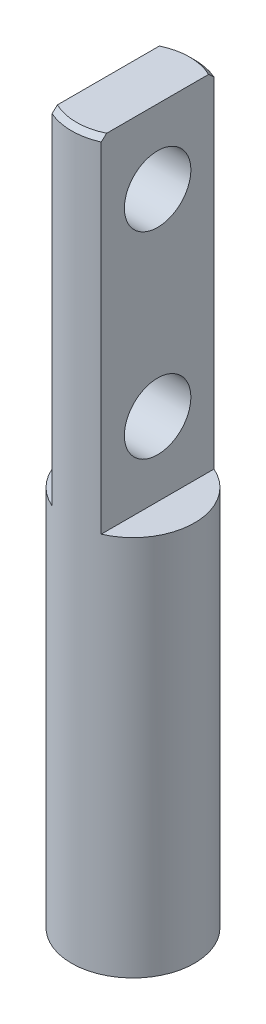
ISO-10303-21;
HEADER;
FILE_DESCRIPTION(('STEP AP214'),'2;1');
FILE_NAME('part.step','',(''),(''),'','','');
FILE_SCHEMA(('AUTOMOTIVE_DESIGN { 1 0 10303 214 1 1 1 1 }'));
ENDSEC;
DATA;
#1=APPLICATION_CONTEXT('core data for automotive mechanical design processes');
#2=APPLICATION_PROTOCOL_DEFINITION('international standard','automotive_design',2000,#1);
#3=PRODUCT_CONTEXT('',#1,'mechanical');
#4=PRODUCT('Part','Part','',(#3));
#5=PRODUCT_RELATED_PRODUCT_CATEGORY('part','',(#4));
#6=PRODUCT_DEFINITION_FORMATION('','',#4);
#7=PRODUCT_DEFINITION_CONTEXT('part definition',#1,'design');
#8=PRODUCT_DEFINITION('design','',#6,#7);
#9=PRODUCT_DEFINITION_SHAPE('','',#8);
#10=(LENGTH_UNIT() NAMED_UNIT(*) SI_UNIT(.MILLI.,.METRE.));
#11=(NAMED_UNIT(*) PLANE_ANGLE_UNIT() SI_UNIT($,.RADIAN.));
#12=(NAMED_UNIT(*) SI_UNIT($,.STERADIAN.) SOLID_ANGLE_UNIT());
#13=UNCERTAINTY_MEASURE_WITH_UNIT(LENGTH_MEASURE(1.E-05),#10,'distance_accuracy_value','');
#14=(GEOMETRIC_REPRESENTATION_CONTEXT(3) GLOBAL_UNCERTAINTY_ASSIGNED_CONTEXT((#13)) GLOBAL_UNIT_ASSIGNED_CONTEXT((#10,
#11,#12)) REPRESENTATION_CONTEXT('',''));
#15=CARTESIAN_POINT('',(0.,0.,0.));
#16=DIRECTION('',(0.,0.,1.));
#17=DIRECTION('',(1.,0.,0.));
#18=AXIS2_PLACEMENT_3D('',#15,#16,#17);
#19=CARTESIAN_POINT('',(0.,15.5,0.));
#20=DIRECTION('',(0.,1.,0.));
#21=DIRECTION('',(0.,0.,1.));
#22=AXIS2_PLACEMENT_3D('',#19,#20,#21);
#23=PLANE('',#22);
#24=DIRECTION('',(0.,0.,-1.));
#25=VECTOR('',#24,1.);
#26=CARTESIAN_POINT('',(1.,15.5,2.29128784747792));
#27=LINE('',#26,#25);
#28=CARTESIAN_POINT('',(1.,15.5,2.29128784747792));
#29=VERTEX_POINT('',#28);
#30=CARTESIAN_POINT('',(1.,15.5,-2.29128784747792));
#31=VERTEX_POINT('',#30);
#32=EDGE_CURVE('E110',#29,#31,#27,.T.);
#33=ORIENTED_EDGE('',*,*,#32,.F.);
#34=CARTESIAN_POINT('',(0.,15.5,0.));
#35=DIRECTION('',(0.,1.,0.));
#36=DIRECTION('',(0.,0.,1.));
#37=AXIS2_PLACEMENT_3D('',#34,#35,#36);
#38=CIRCLE('',#37,2.5);
#39=EDGE_CURVE('E105',#29,#31,#38,.T.);
#40=ORIENTED_EDGE('',*,*,#39,.T.);
#41=EDGE_LOOP('',(#33,#40));
#42=FACE_BOUND('',#41,.T.);
#43=ADVANCED_FACE('F32',(#42),#23,.T.);
#44=CARTESIAN_POINT('',(0.,15.5,0.));
#45=DIRECTION('',(0.,-1.,0.));
#46=DIRECTION('',(0.,0.,-1.));
#47=AXIS2_PLACEMENT_3D('',#44,#45,#46);
#48=CYLINDRICAL_SURFACE('',#47,2.5);
#49=DIRECTION('',(0.,-1.,0.));
#50=VECTOR('',#49,1.);
#51=CARTESIAN_POINT('',(-1.,29.5,-2.29128784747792));
#52=LINE('',#51,#50);
#53=CARTESIAN_POINT('',(-1.,29.3,-2.29128784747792));
#54=VERTEX_POINT('',#53);
#55=CARTESIAN_POINT('',(-1.,15.5,-2.29128784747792));
#56=VERTEX_POINT('',#55);
#57=EDGE_CURVE('E98',#54,#56,#52,.T.);
#58=ORIENTED_EDGE('',*,*,#57,.F.);
#59=CARTESIAN_POINT('',(0.,29.3,0.));
#60=DIRECTION('',(0.,1.,0.));
#61=DIRECTION('',(0.,0.,1.));
#62=AXIS2_PLACEMENT_3D('',#59,#60,#61);
#63=CIRCLE('',#62,2.5);
#64=CARTESIAN_POINT('',(1.,29.3,-2.29128784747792));
#65=VERTEX_POINT('',#64);
#66=EDGE_CURVE('E52',#54,#65,#63,.F.);
#67=ORIENTED_EDGE('',*,*,#66,.T.);
#68=DIRECTION('',(0.,-1.,0.));
#69=VECTOR('',#68,1.);
#70=CARTESIAN_POINT('',(1.,29.5,-2.29128784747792));
#71=LINE('',#70,#69);
#72=EDGE_CURVE('E139',#65,#31,#71,.T.);
#73=ORIENTED_EDGE('',*,*,#72,.T.);
#74=ORIENTED_EDGE('',*,*,#39,.F.);
#75=DIRECTION('',(0.,-1.,0.));
#76=VECTOR('',#75,1.);
#77=CARTESIAN_POINT('',(1.,29.5,2.29128784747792));
#78=LINE('',#77,#76);
#79=CARTESIAN_POINT('',(1.,29.3,2.29128784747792));
#80=VERTEX_POINT('',#79);
#81=EDGE_CURVE('E99',#80,#29,#78,.T.);
#82=ORIENTED_EDGE('',*,*,#81,.F.);
#83=CARTESIAN_POINT('',(0.,29.3,0.));
#84=DIRECTION('',(0.,1.,0.));
#85=DIRECTION('',(0.,0.,1.));
#86=AXIS2_PLACEMENT_3D('',#83,#84,#85);
#87=CIRCLE('',#86,2.5);
#88=CARTESIAN_POINT('',(-1.,29.3,2.29128784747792));
#89=VERTEX_POINT('',#88);
#90=EDGE_CURVE('E94',#80,#89,#87,.F.);
#91=ORIENTED_EDGE('',*,*,#90,.T.);
#92=DIRECTION('',(0.,-1.,0.));
#93=VECTOR('',#92,1.);
#94=CARTESIAN_POINT('',(-1.,29.5,2.29128784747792));
#95=LINE('',#94,#93);
#96=CARTESIAN_POINT('',(-1.,15.5,2.29128784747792));
#97=VERTEX_POINT('',#96);
#98=EDGE_CURVE('E88',#89,#97,#95,.T.);
#99=ORIENTED_EDGE('',*,*,#98,.T.);
#100=EDGE_CURVE('E92',#56,#97,#38,.T.);
#101=ORIENTED_EDGE('',*,*,#100,.F.);
#102=EDGE_LOOP('',(#58,#67,#73,#74,#82,#91,#99,#101));
#103=FACE_BOUND('',#102,.T.);
#104=CARTESIAN_POINT('',(0.,0.,0.));
#105=DIRECTION('',(0.,1.,0.));
#106=DIRECTION('',(0.,0.,1.));
#107=AXIS2_PLACEMENT_3D('',#104,#105,#106);
#108=CIRCLE('',#107,2.5);
#109=CARTESIAN_POINT('',(0.,0.,2.5));
#110=VERTEX_POINT('',#109);
#111=EDGE_CURVE('E106',#110,#110,#108,.T.);
#112=ORIENTED_EDGE('',*,*,#111,.T.);
#113=EDGE_LOOP('',(#112));
#114=FACE_BOUND('',#113,.T.);
#115=ADVANCED_FACE('F90',(#103,#114),#48,.T.);
#116=DIRECTION('',(0.,0.,1.));
#117=VECTOR('',#116,1.);
#118=CARTESIAN_POINT('',(-1.,15.5,2.29128784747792));
#119=LINE('',#118,#117);
#120=EDGE_CURVE('E104',#56,#97,#119,.T.);
#121=ORIENTED_EDGE('',*,*,#120,.F.);
#122=ORIENTED_EDGE('',*,*,#100,.T.);
#123=EDGE_LOOP('',(#121,#122));
#124=FACE_BOUND('',#123,.T.);
#125=ADVANCED_FACE('F103',(#124),#23,.T.);
#126=CARTESIAN_POINT('',(0.,0.,0.));
#127=DIRECTION('',(0.,1.,0.));
#128=DIRECTION('',(0.,0.,1.));
#129=AXIS2_PLACEMENT_3D('',#126,#127,#128);
#130=PLANE('',#129);
#131=ORIENTED_EDGE('',*,*,#111,.F.);
#132=EDGE_LOOP('',(#131));
#133=FACE_BOUND('',#132,.T.);
#134=ADVANCED_FACE('F160',(#133),#130,.F.);
#135=CARTESIAN_POINT('',(-1.,29.5,2.29128784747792));
#136=DIRECTION('',(1.,0.,0.));
#137=DIRECTION('',(0.,0.,-1.));
#138=AXIS2_PLACEMENT_3D('',#135,#136,#137);
#139=PLANE('',#138);
#140=CARTESIAN_POINT('',(-1.,18.5,0.));
#141=DIRECTION('',(-1.,0.,0.));
#142=DIRECTION('',(0.,0.,1.));
#143=AXIS2_PLACEMENT_3D('',#140,#141,#142);
#144=CIRCLE('',#143,1.35);
#145=CARTESIAN_POINT('',(-1.,18.5,1.35));
#146=VERTEX_POINT('',#145);
#147=EDGE_CURVE('E292',#146,#146,#144,.T.);
#148=ORIENTED_EDGE('',*,*,#147,.F.);
#149=EDGE_LOOP('',(#148));
#150=FACE_BOUND('',#149,.T.);
#151=CARTESIAN_POINT('',(-1.,26.5,0.));
#152=DIRECTION('',(-1.,0.,0.));
#153=DIRECTION('',(0.,0.,1.));
#154=AXIS2_PLACEMENT_3D('',#151,#152,#153);
#155=CIRCLE('',#154,1.35);
#156=CARTESIAN_POINT('',(-1.,26.5,1.35));
#157=VERTEX_POINT('',#156);
#158=EDGE_CURVE('E117',#157,#157,#155,.T.);
#159=ORIENTED_EDGE('',*,*,#158,.F.);
#160=EDGE_LOOP('',(#159));
#161=FACE_BOUND('',#160,.T.);
#162=DIRECTION('',(0.,0.,1.));
#163=VECTOR('',#162,1.);
#164=CARTESIAN_POINT('',(-1.,29.5,2.29128784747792));
#165=LINE('',#164,#163);
#166=CARTESIAN_POINT('',(-1.,29.5,-2.07123151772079));
#167=VERTEX_POINT('',#166);
#168=CARTESIAN_POINT('',(-1.,29.5,2.07123151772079));
#169=VERTEX_POINT('',#168);
#170=EDGE_CURVE('E114',#167,#169,#165,.T.);
#171=ORIENTED_EDGE('',*,*,#170,.F.);
#172=CARTESIAN_POINT('',(-1.,29.5,-2.07123151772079));
#173=CARTESIAN_POINT('',(-1.,29.4668268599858,-2.10805317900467));
#174=CARTESIAN_POINT('',(-1.,29.4335736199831,-2.14480204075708));
#175=CARTESIAN_POINT('',(-1.,29.3669069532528,-2.21815415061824));
#176=CARTESIAN_POINT('',(-1.,29.3334935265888,-2.25475739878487));
#177=CARTESIAN_POINT('',(-1.,29.3,-2.29128784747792));
#178=B_SPLINE_CURVE_WITH_KNOTS('',3,(#172,#173,#174,#175,#176,#177),.UNSPECIFIED.,.F.,.F.,(4,2,
4),(0.,0.148681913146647,0.297363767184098),.UNSPECIFIED.);
#179=EDGE_CURVE('E144',#167,#54,#178,.T.);
#180=ORIENTED_EDGE('',*,*,#179,.T.);
#181=ORIENTED_EDGE('',*,*,#57,.T.);
#182=ORIENTED_EDGE('',*,*,#120,.T.);
#183=ORIENTED_EDGE('',*,*,#98,.F.);
#184=CARTESIAN_POINT('',(-1.,29.3,2.29128784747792));
#185=CARTESIAN_POINT('',(-1.,29.3334935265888,2.25475739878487));
#186=CARTESIAN_POINT('',(-1.,29.3669069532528,2.21815415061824));
#187=CARTESIAN_POINT('',(-1.,29.4335736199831,2.14480204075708));
#188=CARTESIAN_POINT('',(-1.,29.4668268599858,2.10805317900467));
#189=CARTESIAN_POINT('',(-1.,29.5,2.07123151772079));
#190=B_SPLINE_CURVE_WITH_KNOTS('',3,(#184,#185,#186,#187,#188,#189),.UNSPECIFIED.,.F.,.F.,(4,2,
4),(0.,0.148681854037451,0.297363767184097),.UNSPECIFIED.);
#191=EDGE_CURVE('E165',#89,#169,#190,.T.);
#192=ORIENTED_EDGE('',*,*,#191,.T.);
#193=EDGE_LOOP('',(#171,#180,#181,#182,#183,#192));
#194=FACE_BOUND('',#193,.T.);
#195=ADVANCED_FACE('F109',(#150,#161,#194),#139,.F.);
#196=CARTESIAN_POINT('',(1.,29.5,2.29128784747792));
#197=DIRECTION('',(-1.,0.,0.));
#198=DIRECTION('',(0.,0.,1.));
#199=AXIS2_PLACEMENT_3D('',#196,#197,#198);
#200=PLANE('',#199);
#201=CARTESIAN_POINT('',(1.,18.5,0.));
#202=DIRECTION('',(-1.,0.,0.));
#203=DIRECTION('',(0.,0.,1.));
#204=AXIS2_PLACEMENT_3D('',#201,#202,#203);
#205=CIRCLE('',#204,1.35);
#206=CARTESIAN_POINT('',(1.,18.5,1.35));
#207=VERTEX_POINT('',#206);
#208=EDGE_CURVE('E289',#207,#207,#205,.T.);
#209=ORIENTED_EDGE('',*,*,#208,.T.);
#210=EDGE_LOOP('',(#209));
#211=FACE_BOUND('',#210,.T.);
#212=CARTESIAN_POINT('',(1.,26.5,0.));
#213=DIRECTION('',(-1.,0.,0.));
#214=DIRECTION('',(0.,0.,1.));
#215=AXIS2_PLACEMENT_3D('',#212,#213,#214);
#216=CIRCLE('',#215,1.35);
#217=CARTESIAN_POINT('',(1.,26.5,1.35));
#218=VERTEX_POINT('',#217);
#219=EDGE_CURVE('E111',#218,#218,#216,.T.);
#220=ORIENTED_EDGE('',*,*,#219,.T.);
#221=EDGE_LOOP('',(#220));
#222=FACE_BOUND('',#221,.T.);
#223=ORIENTED_EDGE('',*,*,#72,.F.);
#224=CARTESIAN_POINT('',(1.,29.3,-2.29128784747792));
#225=CARTESIAN_POINT('',(1.,29.3334935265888,-2.25475739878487));
#226=CARTESIAN_POINT('',(1.,29.3669069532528,-2.21815415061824));
#227=CARTESIAN_POINT('',(1.,29.4335736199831,-2.14480204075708));
#228=CARTESIAN_POINT('',(1.,29.4668268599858,-2.10805317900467));
#229=CARTESIAN_POINT('',(1.,29.5,-2.07123151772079));
#230=B_SPLINE_CURVE_WITH_KNOTS('',3,(#224,#225,#226,#227,#228,#229),.UNSPECIFIED.,.F.,.F.,(4,2,
4),(0.,0.148681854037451,0.297363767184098),.UNSPECIFIED.);
#231=CARTESIAN_POINT('',(1.,29.5,-2.07123151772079));
#232=VERTEX_POINT('',#231);
#233=EDGE_CURVE('E11',#65,#232,#230,.T.);
#234=ORIENTED_EDGE('',*,*,#233,.T.);
#235=DIRECTION('',(0.,0.,-1.));
#236=VECTOR('',#235,1.);
#237=CARTESIAN_POINT('',(1.,29.5,2.29128784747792));
#238=LINE('',#237,#236);
#239=CARTESIAN_POINT('',(1.,29.5,2.07123151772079));
#240=VERTEX_POINT('',#239);
#241=EDGE_CURVE('E127',#240,#232,#238,.T.);
#242=ORIENTED_EDGE('',*,*,#241,.F.);
#243=CARTESIAN_POINT('',(1.,29.5,2.07123151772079));
#244=CARTESIAN_POINT('',(1.,29.4668268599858,2.10805317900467));
#245=CARTESIAN_POINT('',(1.,29.4335736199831,2.14480204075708));
#246=CARTESIAN_POINT('',(1.,29.3669069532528,2.21815415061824));
#247=CARTESIAN_POINT('',(1.,29.3334935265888,2.25475739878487));
#248=CARTESIAN_POINT('',(1.,29.3,2.29128784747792));
#249=B_SPLINE_CURVE_WITH_KNOTS('',3,(#243,#244,#245,#246,#247,#248),.UNSPECIFIED.,.F.,.F.,(4,2,
4),(0.,0.148681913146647,0.297363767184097),.UNSPECIFIED.);
#250=EDGE_CURVE('E45',#240,#80,#249,.T.);
#251=ORIENTED_EDGE('',*,*,#250,.T.);
#252=ORIENTED_EDGE('',*,*,#81,.T.);
#253=ORIENTED_EDGE('',*,*,#32,.T.);
#254=EDGE_LOOP('',(#223,#234,#242,#251,#252,#253));
#255=FACE_BOUND('',#254,.T.);
#256=ADVANCED_FACE('F148',(#211,#222,#255),#200,.F.);
#257=CARTESIAN_POINT('',(0.,29.5,0.));
#258=DIRECTION('',(0.,1.,0.));
#259=DIRECTION('',(0.,0.,1.));
#260=AXIS2_PLACEMENT_3D('',#257,#258,#259);
#261=PLANE('',#260);
#262=ORIENTED_EDGE('',*,*,#241,.T.);
#263=CARTESIAN_POINT('',(0.,29.5,0.));
#264=DIRECTION('',(0.,1.,0.));
#265=DIRECTION('',(0.,0.,1.));
#266=AXIS2_PLACEMENT_3D('',#263,#264,#265);
#267=CIRCLE('',#266,2.3);
#268=EDGE_CURVE('E196',#232,#167,#267,.T.);
#269=ORIENTED_EDGE('',*,*,#268,.T.);
#270=ORIENTED_EDGE('',*,*,#170,.T.);
#271=CARTESIAN_POINT('',(0.,29.5,0.));
#272=DIRECTION('',(0.,1.,0.));
#273=DIRECTION('',(0.,0.,1.));
#274=AXIS2_PLACEMENT_3D('',#271,#272,#273);
#275=CIRCLE('',#274,2.3);
#276=EDGE_CURVE('E194',#169,#240,#275,.T.);
#277=ORIENTED_EDGE('',*,*,#276,.T.);
#278=EDGE_LOOP('',(#262,#269,#270,#277));
#279=FACE_BOUND('',#278,.T.);
#280=ADVANCED_FACE('F153',(#279),#261,.T.);
#281=CARTESIAN_POINT('',(1.,26.5,0.));
#282=DIRECTION('',(-1.,0.,0.));
#283=DIRECTION('',(0.,0.,1.));
#284=AXIS2_PLACEMENT_3D('',#281,#282,#283);
#285=CYLINDRICAL_SURFACE('',#284,1.35);
#286=ORIENTED_EDGE('',*,*,#219,.F.);
#287=EDGE_LOOP('',(#286));
#288=FACE_BOUND('',#287,.T.);
#289=ORIENTED_EDGE('',*,*,#158,.T.);
#290=EDGE_LOOP('',(#289));
#291=FACE_BOUND('',#290,.T.);
#292=ADVANCED_FACE('F222',(#288,#291),#285,.F.);
#293=CARTESIAN_POINT('',(1.,18.5,0.));
#294=DIRECTION('',(-1.,0.,0.));
#295=DIRECTION('',(0.,0.,1.));
#296=AXIS2_PLACEMENT_3D('',#293,#294,#295);
#297=CYLINDRICAL_SURFACE('',#296,1.35);
#298=ORIENTED_EDGE('',*,*,#208,.F.);
#299=EDGE_LOOP('',(#298));
#300=FACE_BOUND('',#299,.T.);
#301=ORIENTED_EDGE('',*,*,#147,.T.);
#302=EDGE_LOOP('',(#301));
#303=FACE_BOUND('',#302,.T.);
#304=ADVANCED_FACE('F177',(#300,#303),#297,.F.);
#305=CARTESIAN_POINT('',(0.,29.5,0.));
#306=DIRECTION('',(0.,-1.,0.));
#307=DIRECTION('',(0.,0.,-1.));
#308=AXIS2_PLACEMENT_3D('',#305,#306,#307);
#309=CONICAL_SURFACE('',#308,2.3,0.785398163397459);
#310=ORIENTED_EDGE('',*,*,#233,.F.);
#311=ORIENTED_EDGE('',*,*,#66,.F.);
#312=ORIENTED_EDGE('',*,*,#179,.F.);
#313=ORIENTED_EDGE('',*,*,#268,.F.);
#314=EDGE_LOOP('',(#310,#311,#312,#313));
#315=FACE_BOUND('',#314,.T.);
#316=ADVANCED_FACE('F173',(#315),#309,.T.);
#317=CARTESIAN_POINT('',(0.,29.5,0.));
#318=DIRECTION('',(0.,-1.,0.));
#319=DIRECTION('',(0.,0.,-1.));
#320=AXIS2_PLACEMENT_3D('',#317,#318,#319);
#321=CONICAL_SURFACE('',#320,2.3,0.785398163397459);
#322=ORIENTED_EDGE('',*,*,#191,.F.);
#323=ORIENTED_EDGE('',*,*,#90,.F.);
#324=ORIENTED_EDGE('',*,*,#250,.F.);
#325=ORIENTED_EDGE('',*,*,#276,.F.);
#326=EDGE_LOOP('',(#322,#323,#324,#325));
#327=FACE_BOUND('',#326,.T.);
#328=ADVANCED_FACE('F34',(#327),#321,.T.);
#329=CLOSED_SHELL('',(#43,#115,#125,#134,#195,#256,#280,#292,#304,#316,#328));
#330=MANIFOLD_SOLID_BREP('B2',#329);
#331=ADVANCED_BREP_SHAPE_REPRESENTATION('',(#18,#330),#14);
#332=SHAPE_DEFINITION_REPRESENTATION(#9,#331);
ENDSEC;
END-ISO-10303-21;
